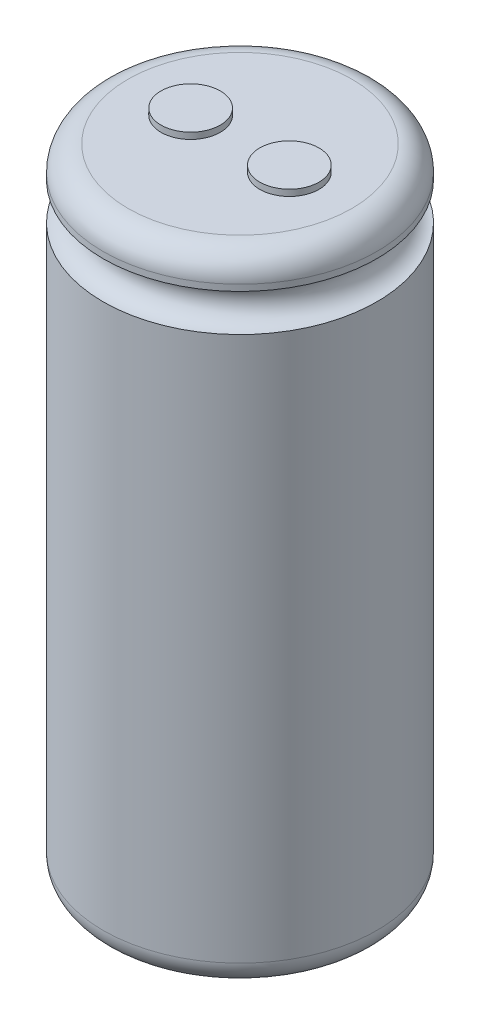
from build123d import *

# Parameters (mm, degrees)
SKETCH2_R           = 2.38125
BOSS_EXTRUDE1_DEPTH = 0.508


with BuildPart() as part:
    # Sketch1 → Revolve1 (revolve)
    with BuildSketch(Plane(origin=(0, 0, 0), x_dir=(0, 0, -1), z_dir=(1, 0, 0)), mode=Mode.PRIVATE) as revolve1_sk:
        with BuildLine():
            Line((0, 0), (9, 0))
            ThreePointArc((9, 0), (10.414213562, 0.585786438), (11, 2))
            Line((11, 2), (11, 45.7572))
            ThreePointArc((11, 45.7572), (9.5, 47.2572), (11, 48.7572))
            Line((11, 48.7572), (11, 49.2572))
            ThreePointArc((11, 49.2572), (10.414213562, 50.671413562), (9, 51.2572))
            Line((9, 51.2572), (0, 51.2572))
            Line((0, 51.2572), (0, 0))
        make_face()
    revolve(revolve1_sk.sketch.rotate(Axis((0, 51.2572, 0), (0, -1, 0)), 180), axis=Axis((0, 51.2572, 0), (0, -1, 0)))

    # Sketch2 → Boss-Extrude1 (add)
    with BuildSketch(Plane(origin=(0, 51.2572, 0), x_dir=(1, 0, 0), z_dir=(0, 1, 0))):
        with Locations(Location((-3.96875, 0, 0), (0, 0, 90))):
            Circle(SKETCH2_R)
        with Locations(Location((3.96875, 0, 0), (0, 0, 90))):
            Circle(SKETCH2_R)
    extrude(amount=BOSS_EXTRUDE1_DEPTH)


solid = part.part
